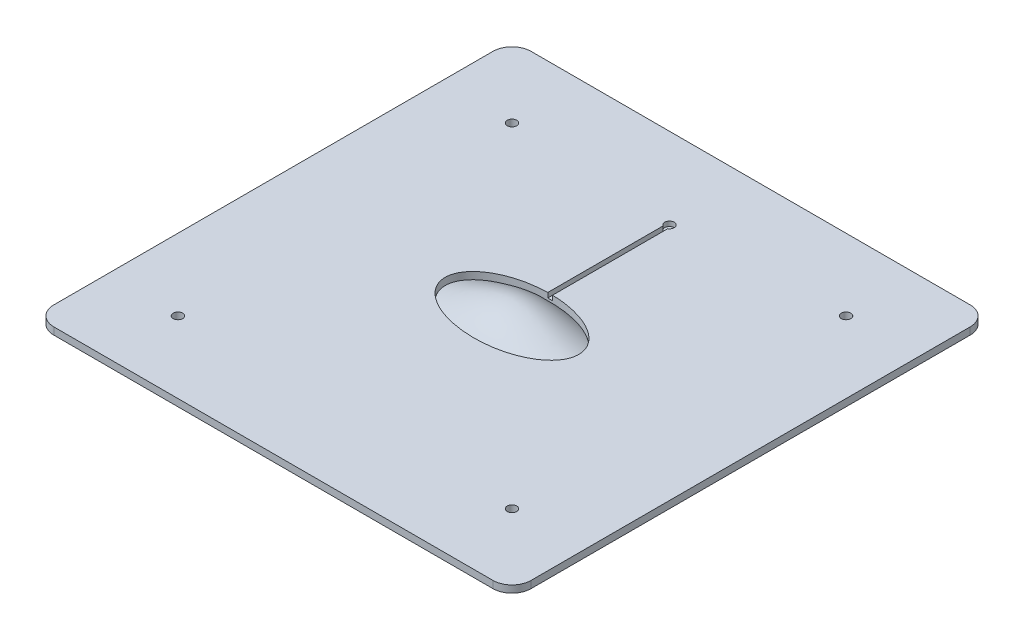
from build123d import *

# Parameters (mm, degrees)
EXTRUDE_1_DEPTH       = 1.5
SKETCH_2_RX           = 14
SKETCH_2_RY           = 8
CUT_EXTRUDE_2_DEPTH   = 10
SKETCH_7_W            = 1
SKETCH_7_H            = 21.779714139
CUT_EXTRUDE_2_2_DEPTH = 1
SKETCH_9_W            = 1
SKETCH_9_H            = 4.490993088
CUT_EXTRUDE_3_DEPTH   = 1
SKETCH_10_R           = 1
CUT_EXTRUDE_4_DEPTH   = 71.726586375
SKETCH_11_R           = 1
CUT_EXTRUDE_5_DEPTH   = 1


with BuildPart() as part:
    # Sketch 1 → Extrude 1 (new body)
    with BuildSketch(Plane(origin=(0, 0, 0), x_dir=(1, 0, 0), z_dir=(0, 1, 0))):
        with BuildLine():
            Line((46, -50), (-46, -50))
            ThreePointArc((-46, -50), (-48.828427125, -48.828427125), (-50, -46))
            Line((-50, -46), (-50, 46))
            ThreePointArc((-50, 46), (-48.828427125, 48.828427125), (-46, 50))
            Line((-46, 50), (46, 50))
            ThreePointArc((46, 50), (48.828427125, 48.828427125), (50, 46))
            Line((50, 46), (50, -46))
            ThreePointArc((50, -46), (48.828427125, -48.828427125), (46, -50))
        make_face()
    extrude(amount=EXTRUDE_1_DEPTH)

    # Sketch 2 → Cut-Extrude 2 (cut)
    with BuildSketch(Plane(origin=(0, 1.5, 0), x_dir=(1, 0, 0), z_dir=(0, 1, 0))):
        with Locations(Location((0, 0), (0, 0, 180))):
            Ellipse(SKETCH_2_RX, SKETCH_2_RY)
    extrude(amount=-CUT_EXTRUDE_2_DEPTH, mode=Mode.SUBTRACT)

    # Sketch 7 → Cut-Extrude 2 2 (cut)
    with BuildSketch(Plane(origin=(0, 1.5, 0), x_dir=(1, 0, 0), z_dir=(0, 1, 0))):
        with Locations((0, 22.110142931)):
            Rectangle(SKETCH_7_W, SKETCH_7_H)
    extrude(amount=-CUT_EXTRUDE_2_2_DEPTH, mode=Mode.SUBTRACT)

    # Sketch 9 → Cut-Extrude 3 (cut)
    with BuildSketch(Plane(origin=(0, 1.5, 0), x_dir=(1, 0, 0), z_dir=(0, 1, 0))):
        with Locations((0, 8.974789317)):
            Rectangle(SKETCH_9_W, SKETCH_9_H)
    extrude(amount=-CUT_EXTRUDE_3_DEPTH, mode=Mode.SUBTRACT)

    # Sketch 10 → Cut-Extrude 4 (cut, through all)
    with BuildSketch(Plane(origin=(0, 1.5, 0), x_dir=(1, 0, 0), z_dir=(0, 1, 0))):
        with Locations(Location((-35, 35, 0), (0, 0, 270))):
            Circle(SKETCH_10_R)
        with Locations(Location((35, 35, 0), (0, 0, 270))):
            Circle(SKETCH_10_R)
        with Locations(Location((35, -35, 0), (0, 0, 270))):
            Circle(SKETCH_10_R)
        with Locations(Location((-35, -35, 0), (0, 0, 270))):
            Circle(SKETCH_10_R)
    extrude(amount=-CUT_EXTRUDE_4_DEPTH, mode=Mode.SUBTRACT)

    # Sketch 11 → Cut-Extrude 5 (cut)
    with BuildSketch(Plane(origin=(0, 1.5, 0), x_dir=(1, 0, 0), z_dir=(0, 1, 0))):
        with Locations((0, 33)):
            Circle(SKETCH_11_R)
    extrude(amount=-CUT_EXTRUDE_5_DEPTH, mode=Mode.SUBTRACT)


solid = part.part
